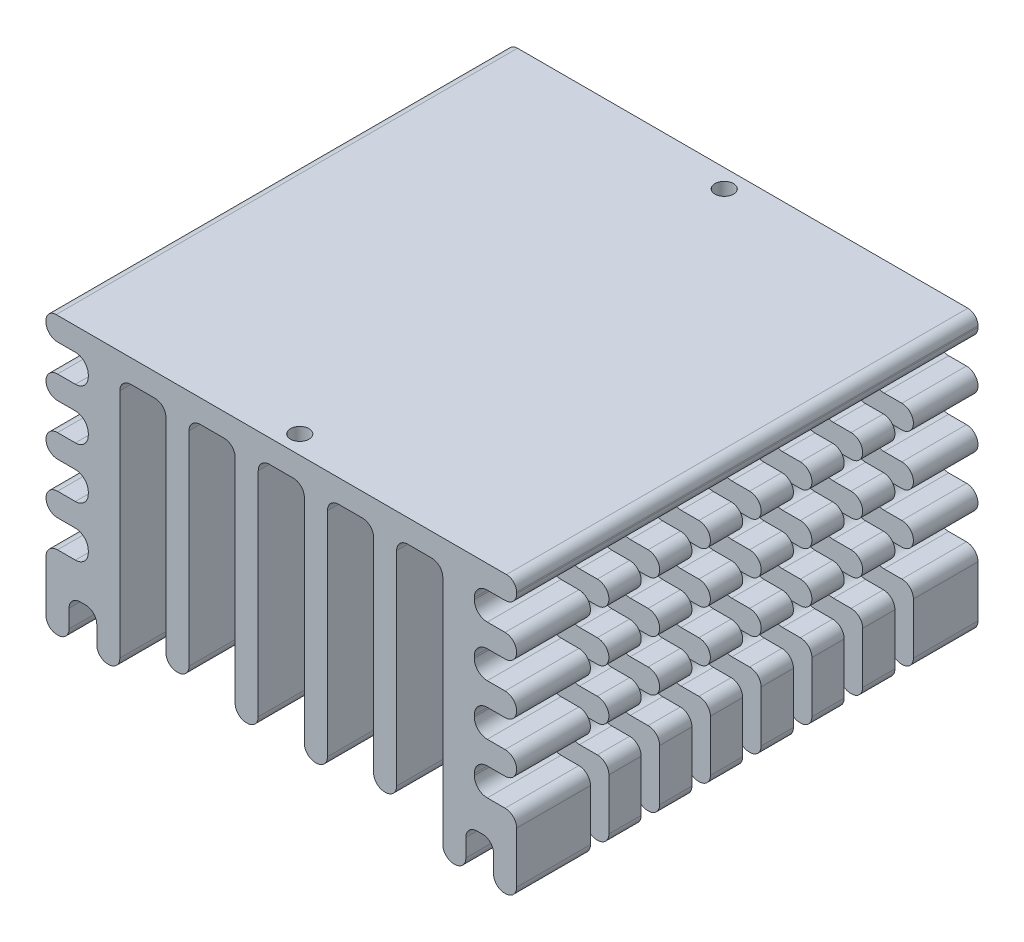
from build123d import *

# Parameters (mm, degrees)
EXTRUSION1_DEPTH             = 50
ENL_V_MAT_EXTRU_1_DEPTH      = 50
ENL_V_MAT_EXTRU_1_DEPTH_BACK = 50
ESQUISSE3_R                  = 1
ENL_V_MAT_EXTRU_2_DEPTH      = 50


with BuildPart() as part:
    # Esquisse1 → Extrusion1 (new body)
    with BuildSketch(Plane.XY):
        with BuildLine():
            Line((6.247038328, 24.5), (4.314628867, 24.5))
            ThreePointArc((4.314628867, 24.5), (3.324679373, 24.089949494), (2.914628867, 23.1))
            Line((2.914628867, 23.1), (2.914628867, 22.9))
            ThreePointArc((2.914628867, 22.9), (3.324679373, 21.910050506), (4.314628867, 21.5))
            Line((4.314628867, 21.5), (6.247038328, 21.5))
            ThreePointArc((6.247038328, 21.5), (7.130921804, 21.133883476), (7.497038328, 20.25))
            ThreePointArc((7.497038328, 20.25), (7.130921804, 19.366116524), (6.247038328, 19))
            Line((6.247038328, 19), (4.314628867, 19))
            ThreePointArc((4.314628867, 19), (3.324679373, 18.589949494), (2.914628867, 17.6))
            Line((2.914628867, 17.6), (2.914628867, 17.4))
            ThreePointArc((2.914628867, 17.4), (3.324679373, 16.410050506), (4.314628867, 16))
            Line((4.314628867, 16), (6.247038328, 16))
            ThreePointArc((6.247038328, 16), (7.130921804, 15.633883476), (7.497038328, 14.75))
            ThreePointArc((7.497038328, 14.75), (7.130921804, 13.866116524), (6.247038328, 13.5))
            Line((6.247038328, 13.5), (4.314628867, 13.5))
            ThreePointArc((4.314628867, 13.5), (3.324679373, 13.089949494), (2.914628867, 12.1))
            Line((2.914628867, 12.1), (2.914628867, 11.9))
            ThreePointArc((2.914628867, 11.9), (3.324679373, 10.910050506), (4.314628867, 10.5))
            Line((4.314628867, 10.5), (6.247038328, 10.5))
            ThreePointArc((6.247038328, 10.5), (7.130921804, 10.133883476), (7.497038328, 9.25))
            ThreePointArc((7.497038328, 9.25), (7.130921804, 8.366116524), (6.247038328, 8))
            Line((6.247038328, 8), (4.314628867, 8))
            ThreePointArc((4.314628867, 8), (3.324679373, 7.589949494), (2.914628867, 6.6))
            Line((2.914628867, 6.6), (2.914628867, 6.4))
            ThreePointArc((2.914628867, 6.4), (3.324679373, 5.410050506), (4.314628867, 5))
            Line((4.314628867, 5), (6.247038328, 5))
            ThreePointArc((6.247038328, 5), (7.130921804, 4.633883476), (7.497038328, 3.75))
            Line((7.497038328, 3.75), (7.497038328, -1.8))
            ThreePointArc((7.497038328, -1.8), (7.145566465, -2.648528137), (6.297038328, -3))
            Line((6.297038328, -3), (6.197038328, -3))
            ThreePointArc((6.197038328, -3), (5.34851019, -2.648528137), (4.997038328, -1.8))
            Line((4.997038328, -1.8), (4.997038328, 0.13961136))
            ThreePointArc((4.997038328, 0.13961136), (4.645566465, 0.988139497), (3.797038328, 1.33961136))
            Line((3.797038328, 1.33961136), (3.197038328, 1.33961136))
            ThreePointArc((3.197038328, 1.33961136), (2.34851019, 0.988139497), (1.997038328, 0.13961136))
            Line((1.997038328, 0.13961136), (1.997038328, -1.8))
            ThreePointArc((1.997038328, -1.8), (1.645566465, -2.648528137), (0.797038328, -3))
            Line((0.797038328, -3), (0.697038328, -3))
            ThreePointArc((0.697038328, -3), (-0.15148981, -2.648528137), (-0.502961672, -1.8))
            Line((-0.502961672, -1.8), (-0.502961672, 23.3))
            ThreePointArc((-0.502961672, 23.3), (-0.854433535, 24.148528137), (-1.702961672, 24.5))
            Line((-1.702961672, 24.5), (-4.302961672, 24.5))
            ThreePointArc((-4.302961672, 24.5), (-5.15148981, 24.148528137), (-5.502961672, 23.3))
            Line((-5.502961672, 23.3), (-5.502961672, 1.2))
            ThreePointArc((-5.502961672, 1.2), (-5.854433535, 0.351471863), (-6.702961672, 0))
            Line((-6.702961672, 0), (-6.802961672, 0))
            ThreePointArc((-6.802961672, 0), (-7.65148981, 0.351471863), (-8.002961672, 1.2))
            Line((-8.002961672, 1.2), (-8.002961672, 23.3))
            ThreePointArc((-8.002961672, 23.3), (-8.354433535, 24.148528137), (-9.202961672, 24.5))
            Line((-9.202961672, 24.5), (-11.802961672, 24.5))
            ThreePointArc((-11.802961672, 24.5), (-12.65148981, 24.148528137), (-13.002961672, 23.3))
            Line((-13.002961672, 23.3), (-13.002961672, 0.2))
            ThreePointArc((-13.002961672, 0.2), (-13.354433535, -0.648528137), (-14.202961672, -1))
            Line((-14.202961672, -1), (-14.302961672, -1))
            ThreePointArc((-14.302961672, -1), (-15.15148981, -0.648528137), (-15.502961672, 0.2))
            Line((-15.502961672, 0.2), (-15.502961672, 23.3))
            ThreePointArc((-15.502961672, 23.3), (-15.854433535, 24.148528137), (-16.702961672, 24.5))
            Line((-16.702961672, 24.5), (-19.302961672, 24.5))
            ThreePointArc((-19.302961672, 24.5), (-20.15148981, 24.148528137), (-20.502961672, 23.3))
            Line((-20.502961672, 23.3), (-20.502961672, 0.2))
            ThreePointArc((-20.502961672, 0.2), (-20.854433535, -0.648528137), (-21.702961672, -1))
            Line((-21.702961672, -1), (-21.802961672, -1))
            ThreePointArc((-21.802961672, -1), (-22.65148981, -0.648528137), (-23.002961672, 0.2))
            Line((-23.002961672, 0.2), (-23.002961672, 23.3))
            ThreePointArc((-23.002961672, 23.3), (-23.354433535, 24.148528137), (-24.202961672, 24.5))
            Line((-24.202961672, 24.5), (-26.802961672, 24.5))
            ThreePointArc((-26.802961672, 24.5), (-27.65148981, 24.148528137), (-28.002961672, 23.3))
            Line((-28.002961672, 23.3), (-28.002961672, 1.2))
            ThreePointArc((-28.002961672, 1.2), (-28.354433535, 0.351471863), (-29.202961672, 0))
            Line((-29.202961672, 0), (-29.302961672, 0))
            ThreePointArc((-29.302961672, 0), (-30.15148981, 0.351471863), (-30.502961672, 1.2))
            Line((-30.502961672, 1.2), (-30.502961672, 23.3))
            ThreePointArc((-30.502961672, 23.3), (-30.854433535, 24.148528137), (-31.702961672, 24.5))
            Line((-31.702961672, 24.5), (-34.302961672, 24.5))
            ThreePointArc((-34.302961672, 24.5), (-35.15148981, 24.148528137), (-35.502961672, 23.3))
            Line((-35.502961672, 23.3), (-35.502961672, -1.8))
            ThreePointArc((-35.502961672, -1.8), (-35.854433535, -2.648528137), (-36.702961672, -3))
            Line((-36.702961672, -3), (-36.802961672, -3))
            ThreePointArc((-36.802961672, -3), (-37.65148981, -2.648528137), (-38.002961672, -1.8))
            Line((-38.002961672, -1.8), (-38.002961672, 0.13961136))
            ThreePointArc((-38.002961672, 0.13961136), (-38.354433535, 0.988139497), (-39.202961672, 1.33961136))
            Line((-39.202961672, 1.33961136), (-39.802961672, 1.33961136))
            ThreePointArc((-39.802961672, 1.33961136), (-40.65148981, 0.988139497), (-41.002961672, 0.13961136))
            Line((-41.002961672, 0.13961136), (-41.002961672, -1.8))
            ThreePointArc((-41.002961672, -1.8), (-41.354433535, -2.648528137), (-42.202961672, -3))
            Line((-42.202961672, -3), (-42.302961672, -3))
            ThreePointArc((-42.302961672, -3), (-43.15148981, -2.648528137), (-43.502961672, -1.8))
            Line((-43.502961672, -1.8), (-43.502961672, 3.75))
            ThreePointArc((-43.502961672, 3.75), (-43.136845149, 4.633883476), (-42.252961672, 5))
            Line((-42.252961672, 5), (-40.320552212, 5))
            ThreePointArc((-40.320552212, 5), (-39.330602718, 5.410050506), (-38.920552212, 6.4))
            Line((-38.920552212, 6.4), (-38.920552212, 6.6))
            ThreePointArc((-38.920552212, 6.6), (-39.330602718, 7.589949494), (-40.320552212, 8))
            Line((-40.320552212, 8), (-42.252961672, 8))
            ThreePointArc((-42.252961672, 8), (-43.136845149, 8.366116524), (-43.502961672, 9.25))
            ThreePointArc((-43.502961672, 9.25), (-43.136845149, 10.133883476), (-42.252961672, 10.5))
            Line((-42.252961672, 10.5), (-40.320552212, 10.5))
            ThreePointArc((-40.320552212, 10.5), (-39.330602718, 10.910050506), (-38.920552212, 11.9))
            Line((-38.920552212, 11.9), (-38.920552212, 12.1))
            ThreePointArc((-38.920552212, 12.1), (-39.330602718, 13.089949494), (-40.320552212, 13.5))
            Line((-40.320552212, 13.5), (-42.252961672, 13.5))
            ThreePointArc((-42.252961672, 13.5), (-43.136845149, 13.866116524), (-43.502961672, 14.75))
            ThreePointArc((-43.502961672, 14.75), (-43.136845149, 15.633883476), (-42.252961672, 16))
            Line((-42.252961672, 16), (-40.320552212, 16))
            ThreePointArc((-40.320552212, 16), (-39.330602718, 16.410050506), (-38.920552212, 17.4))
            Line((-38.920552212, 17.4), (-38.920552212, 17.6))
            ThreePointArc((-38.920552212, 17.6), (-39.330602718, 18.589949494), (-40.320552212, 19))
            Line((-40.320552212, 19), (-42.252961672, 19))
            ThreePointArc((-42.252961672, 19), (-43.136845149, 19.366116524), (-43.502961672, 20.25))
            ThreePointArc((-43.502961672, 20.25), (-43.136845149, 21.133883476), (-42.252961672, 21.5))
            Line((-42.252961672, 21.5), (-40.320552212, 21.5))
            ThreePointArc((-40.320552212, 21.5), (-39.330602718, 21.910050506), (-38.920552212, 22.9))
            Line((-38.920552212, 22.9), (-38.920552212, 23.1))
            ThreePointArc((-38.920552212, 23.1), (-39.330602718, 24.089949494), (-40.320552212, 24.5))
            Line((-40.320552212, 24.5), (-42.252961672, 24.5))
            ThreePointArc((-42.252961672, 24.5), (-43.136845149, 24.866116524), (-43.502961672, 25.75))
            Line((-43.502961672, 25.75), (-43.502961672, 25.9))
            ThreePointArc((-43.502961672, 25.9), (-43.180779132, 26.677817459), (-42.402961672, 27))
            Line((-42.402961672, 27), (6.397038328, 27))
            ThreePointArc((6.397038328, 27), (7.174855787, 26.677817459), (7.497038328, 25.9))
            Line((7.497038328, 25.9), (7.497038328, 25.75))
            ThreePointArc((7.497038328, 25.75), (7.130921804, 24.866116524), (6.247038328, 24.5))
        make_face()
    extrude(amount=EXTRUSION1_DEPTH)

    # Esquisse2 → Enl_v. mat.-Extru.1 (cut, two sides: drawn at the far end of the back side and taken through both)
    with BuildSketch(Plane(origin=(0, 0, 0), x_dir=(0, 0, -1), z_dir=(1, 0, 0)).offset(-ENL_V_MAT_EXTRU_1_DEPTH_BACK)):
        Polygon((-42, 24.5), (-40, 24.5), (-40, -6.24868898), (-36.5, -6.24868898), (-36.5, 24.5), (-34.5, 24.5), (-34.5, -6.24868898), (-31, -6.24868898), (-31, 24.5), (-29, 24.5), (-29, -6.24868898), (-25.5, -6.24868898), (-25.5, 24.5), (-23.5, 24.5), (-23.5, -6.24868898), (-20, -6.24868898), (-20, 24.5), (-18, 24.5), (-18, -6.24868898), (-14.5, -6.24868898), (-14.5, 24.5), (-12.5, 24.5), (-12.5, -6.24868898), (-9, -6.24868898), (-9, 24.5), (-7, 24.5), (-7, -6.24868898), (-7, -10.810861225), (-42, -10.810861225), (-42, -6.24868898), align=None)
    extrude(amount=ENL_V_MAT_EXTRU_1_DEPTH + ENL_V_MAT_EXTRU_1_DEPTH_BACK, mode=Mode.SUBTRACT)

    # Esquisse3 → Enl_v. mat.-Extru.2 (cut)
    with BuildSketch(Plane.XZ.offset(-24.5)):
        with Locations((-18.002961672, 48)):
            Circle(ESQUISSE3_R)
        with Locations((-18.002961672, 2)):
            Circle(ESQUISSE3_R)
    extrude(amount=-ENL_V_MAT_EXTRU_2_DEPTH, mode=Mode.SUBTRACT)


solid = part.part
